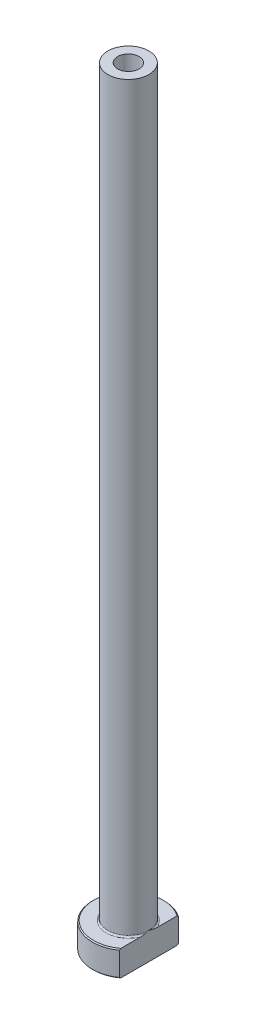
ISO-10303-21;
HEADER;
FILE_DESCRIPTION(('STEP AP214'),'2;1');
FILE_NAME('part.step','',(''),(''),'','','');
FILE_SCHEMA(('AUTOMOTIVE_DESIGN { 1 0 10303 214 1 1 1 1 }'));
ENDSEC;
DATA;
#1=APPLICATION_CONTEXT('core data for automotive mechanical design processes');
#2=APPLICATION_PROTOCOL_DEFINITION('international standard','automotive_design',2000,#1);
#3=PRODUCT_CONTEXT('',#1,'mechanical');
#4=PRODUCT('Part','Part','',(#3));
#5=PRODUCT_RELATED_PRODUCT_CATEGORY('part','',(#4));
#6=PRODUCT_DEFINITION_FORMATION('','',#4);
#7=PRODUCT_DEFINITION_CONTEXT('part definition',#1,'design');
#8=PRODUCT_DEFINITION('design','',#6,#7);
#9=PRODUCT_DEFINITION_SHAPE('','',#8);
#10=(LENGTH_UNIT() NAMED_UNIT(*) SI_UNIT(.MILLI.,.METRE.));
#11=(NAMED_UNIT(*) PLANE_ANGLE_UNIT() SI_UNIT($,.RADIAN.));
#12=(NAMED_UNIT(*) SI_UNIT($,.STERADIAN.) SOLID_ANGLE_UNIT());
#13=UNCERTAINTY_MEASURE_WITH_UNIT(LENGTH_MEASURE(1.E-05),#10,'distance_accuracy_value','');
#14=(GEOMETRIC_REPRESENTATION_CONTEXT(3) GLOBAL_UNCERTAINTY_ASSIGNED_CONTEXT((#13)) GLOBAL_UNIT_ASSIGNED_CONTEXT((#10,
#11,#12)) REPRESENTATION_CONTEXT('',''));
#15=CARTESIAN_POINT('',(0.,0.,0.));
#16=DIRECTION('',(0.,0.,1.));
#17=DIRECTION('',(1.,0.,0.));
#18=AXIS2_PLACEMENT_3D('',#15,#16,#17);
#19=CARTESIAN_POINT('',(0.,92.1876809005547,0.));
#20=DIRECTION('',(0.,1.,0.));
#21=DIRECTION('',(0.,0.,1.));
#22=AXIS2_PLACEMENT_3D('',#19,#20,#21);
#23=CYLINDRICAL_SURFACE('',#22,2.1);
#24=CARTESIAN_POINT('',(0.,150.,0.));
#25=DIRECTION('',(0.,1.,0.));
#26=DIRECTION('',(0.,0.,1.));
#27=AXIS2_PLACEMENT_3D('',#24,#25,#26);
#28=CIRCLE('',#27,2.1);
#29=CARTESIAN_POINT('',(0.,150.,2.1));
#30=VERTEX_POINT('',#29);
#31=EDGE_CURVE('E167',#30,#30,#28,.T.);
#32=ORIENTED_EDGE('',*,*,#31,.T.);
#33=EDGE_LOOP('',(#32));
#34=FACE_BOUND('',#33,.T.);
#35=CARTESIAN_POINT('',(0.,105.,0.));
#36=DIRECTION('',(0.,1.,0.));
#37=DIRECTION('',(0.,0.,1.));
#38=AXIS2_PLACEMENT_3D('',#35,#36,#37);
#39=CIRCLE('',#38,2.1);
#40=CARTESIAN_POINT('',(0.,105.,2.1));
#41=VERTEX_POINT('',#40);
#42=EDGE_CURVE('E170',#41,#41,#39,.T.);
#43=ORIENTED_EDGE('',*,*,#42,.F.);
#44=EDGE_LOOP('',(#43));
#45=FACE_BOUND('',#44,.T.);
#46=ADVANCED_FACE('F32',(#34,#45),#23,.F.);
#47=CARTESIAN_POINT('',(-2.1,150.,0.));
#48=DIRECTION('',(0.,1.,0.));
#49=DIRECTION('',(0.,0.,1.));
#50=AXIS2_PLACEMENT_3D('',#47,#48,#49);
#51=PLANE('',#50);
#52=CARTESIAN_POINT('',(0.,150.,0.));
#53=DIRECTION('',(0.,1.,0.));
#54=DIRECTION('',(0.,0.,1.));
#55=AXIS2_PLACEMENT_3D('',#52,#53,#54);
#56=CIRCLE('',#55,4.00000000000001);
#57=CARTESIAN_POINT('',(0.,150.,4.00000000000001));
#58=VERTEX_POINT('',#57);
#59=EDGE_CURVE('E174',#58,#58,#56,.T.);
#60=ORIENTED_EDGE('',*,*,#59,.T.);
#61=EDGE_LOOP('',(#60));
#62=FACE_BOUND('',#61,.T.);
#63=ORIENTED_EDGE('',*,*,#31,.F.);
#64=EDGE_LOOP('',(#63));
#65=FACE_BOUND('',#64,.T.);
#66=ADVANCED_FACE('F157',(#62,#65),#51,.T.);
#67=CARTESIAN_POINT('',(0.,92.1876809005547,0.));
#68=DIRECTION('',(0.,1.,0.));
#69=DIRECTION('',(0.,0.,1.));
#70=AXIS2_PLACEMENT_3D('',#67,#68,#69);
#71=CYLINDRICAL_SURFACE('',#70,4.);
#72=CARTESIAN_POINT('',(0.,5.3,0.));
#73=DIRECTION('',(0.,1.,0.));
#74=DIRECTION('',(0.,0.,1.));
#75=AXIS2_PLACEMENT_3D('',#72,#73,#74);
#76=CIRCLE('',#75,4.);
#77=CARTESIAN_POINT('',(4.,5.3,0.));
#78=VERTEX_POINT('',#77);
#79=EDGE_CURVE('E180',#78,#78,#76,.T.);
#80=ORIENTED_EDGE('',*,*,#79,.T.);
#81=EDGE_LOOP('',(#80));
#82=FACE_BOUND('',#81,.T.);
#83=ORIENTED_EDGE('',*,*,#59,.F.);
#84=EDGE_LOOP('',(#83));
#85=FACE_BOUND('',#84,.T.);
#86=ADVANCED_FACE('F162',(#82,#85),#71,.T.);
#87=CARTESIAN_POINT('',(-3.99999999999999,5.,0.));
#88=DIRECTION('',(0.,1.,0.));
#89=DIRECTION('',(0.,0.,1.));
#90=AXIS2_PLACEMENT_3D('',#87,#88,#89);
#91=PLANE('',#90);
#92=DIRECTION('',(0.,0.,1.));
#93=VECTOR('',#92,1.);
#94=CARTESIAN_POINT('',(4.,5.,0.));
#95=LINE('',#94,#93);
#96=CARTESIAN_POINT('',(4.,5.,-5.49909083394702));
#97=VERTEX_POINT('',#96);
#98=CARTESIAN_POINT('',(4.,5.,-1.57797338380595));
#99=VERTEX_POINT('',#98);
#100=EDGE_CURVE('E54',#97,#99,#95,.T.);
#101=ORIENTED_EDGE('',*,*,#100,.F.);
#102=CARTESIAN_POINT('',(0.,5.,0.));
#103=DIRECTION('',(0.,1.,0.));
#104=DIRECTION('',(0.,0.,1.));
#105=AXIS2_PLACEMENT_3D('',#102,#103,#104);
#106=CIRCLE('',#105,6.80000000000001);
#107=CARTESIAN_POINT('',(3.99999999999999,5.,5.49909083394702));
#108=VERTEX_POINT('',#107);
#109=EDGE_CURVE('E186',#97,#108,#106,.T.);
#110=ORIENTED_EDGE('',*,*,#109,.T.);
#111=CARTESIAN_POINT('',(4.,5.,1.57797338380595));
#112=VERTEX_POINT('',#111);
#113=EDGE_CURVE('E134',#112,#108,#95,.T.);
#114=ORIENTED_EDGE('',*,*,#113,.F.);
#115=CARTESIAN_POINT('',(0.,5.,0.));
#116=DIRECTION('',(0.,1.,0.));
#117=DIRECTION('',(0.,0.,1.));
#118=AXIS2_PLACEMENT_3D('',#115,#116,#117);
#119=CIRCLE('',#118,4.3);
#120=EDGE_CURVE('E183',#112,#99,#119,.F.);
#121=ORIENTED_EDGE('',*,*,#120,.T.);
#122=EDGE_LOOP('',(#101,#110,#114,#121));
#123=FACE_BOUND('',#122,.T.);
#124=ADVANCED_FACE('F197',(#123),#91,.T.);
#125=CARTESIAN_POINT('',(0.,92.1876809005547,0.));
#126=DIRECTION('',(0.,1.,0.));
#127=DIRECTION('',(0.,0.,1.));
#128=AXIS2_PLACEMENT_3D('',#125,#126,#127);
#129=CYLINDRICAL_SURFACE('',#128,6.99999999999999);
#130=DIRECTION('',(0.,-1.,0.));
#131=VECTOR('',#130,1.);
#132=CARTESIAN_POINT('',(3.99999999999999,150.,5.74456264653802));
#133=LINE('',#132,#131);
#134=CARTESIAN_POINT('',(3.99999999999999,4.8,5.74456264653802));
#135=VERTEX_POINT('',#134);
#136=CARTESIAN_POINT('',(3.99999999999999,0.200000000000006,5.74456264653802));
#137=VERTEX_POINT('',#136);
#138=EDGE_CURVE('E82',#135,#137,#133,.T.);
#139=ORIENTED_EDGE('',*,*,#138,.F.);
#140=CARTESIAN_POINT('',(0.,4.8,0.));
#141=DIRECTION('',(0.,1.,0.));
#142=DIRECTION('',(0.,0.,1.));
#143=AXIS2_PLACEMENT_3D('',#140,#141,#142);
#144=CIRCLE('',#143,6.99999999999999);
#145=CARTESIAN_POINT('',(4.,4.8,-5.74456264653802));
#146=VERTEX_POINT('',#145);
#147=EDGE_CURVE('E95',#135,#146,#144,.F.);
#148=ORIENTED_EDGE('',*,*,#147,.T.);
#149=DIRECTION('',(0.,-1.,0.));
#150=VECTOR('',#149,1.);
#151=CARTESIAN_POINT('',(4.,150.,-5.74456264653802));
#152=LINE('',#151,#150);
#153=CARTESIAN_POINT('',(4.,0.200000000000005,-5.74456264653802));
#154=VERTEX_POINT('',#153);
#155=EDGE_CURVE('E192',#146,#154,#152,.T.);
#156=ORIENTED_EDGE('',*,*,#155,.T.);
#157=CARTESIAN_POINT('',(0.,0.200000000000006,0.));
#158=DIRECTION('',(0.,-1.,0.));
#159=DIRECTION('',(0.,0.,-1.));
#160=AXIS2_PLACEMENT_3D('',#157,#158,#159);
#161=CIRCLE('',#160,6.99999999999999);
#162=EDGE_CURVE('E98',#154,#137,#161,.F.);
#163=ORIENTED_EDGE('',*,*,#162,.T.);
#164=EDGE_LOOP('',(#139,#148,#156,#163));
#165=FACE_BOUND('',#164,.T.);
#166=ADVANCED_FACE('F190',(#165),#129,.T.);
#167=CARTESIAN_POINT('',(-6.99999999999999,0.,0.));
#168=DIRECTION('',(0.,-1.,0.));
#169=DIRECTION('',(0.,0.,-1.));
#170=AXIS2_PLACEMENT_3D('',#167,#168,#169);
#171=PLANE('',#170);
#172=CARTESIAN_POINT('',(0.,0.,0.));
#173=DIRECTION('',(0.,-1.,0.));
#174=DIRECTION('',(0.,0.,-1.));
#175=AXIS2_PLACEMENT_3D('',#172,#173,#174);
#176=CIRCLE('',#175,2.84999999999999);
#177=CARTESIAN_POINT('',(0.,0.,-2.84999999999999));
#178=VERTEX_POINT('',#177);
#179=EDGE_CURVE('E40',#178,#178,#176,.F.);
#180=ORIENTED_EDGE('',*,*,#179,.T.);
#181=EDGE_LOOP('',(#180));
#182=FACE_BOUND('',#181,.T.);
#183=DIRECTION('',(0.,0.,-1.));
#184=VECTOR('',#183,1.);
#185=CARTESIAN_POINT('',(3.99999999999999,0.,5.74456264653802));
#186=LINE('',#185,#184);
#187=CARTESIAN_POINT('',(3.99999999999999,0.,5.49909083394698));
#188=VERTEX_POINT('',#187);
#189=CARTESIAN_POINT('',(4.,0.,-5.49909083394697));
#190=VERTEX_POINT('',#189);
#191=EDGE_CURVE('E47',#188,#190,#186,.T.);
#192=ORIENTED_EDGE('',*,*,#191,.F.);
#193=CARTESIAN_POINT('',(0.,0.,0.));
#194=DIRECTION('',(0.,-1.,0.));
#195=DIRECTION('',(0.,0.,-1.));
#196=AXIS2_PLACEMENT_3D('',#193,#194,#195);
#197=CIRCLE('',#196,6.79999999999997);
#198=EDGE_CURVE('E92',#188,#190,#197,.T.);
#199=ORIENTED_EDGE('',*,*,#198,.T.);
#200=EDGE_LOOP('',(#192,#199));
#201=FACE_BOUND('',#200,.T.);
#202=ADVANCED_FACE('F91',(#182,#201),#171,.T.);
#203=CARTESIAN_POINT('',(0.,92.1876809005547,0.));
#204=DIRECTION('',(0.,1.,0.));
#205=DIRECTION('',(0.,0.,1.));
#206=AXIS2_PLACEMENT_3D('',#203,#204,#205);
#207=CYLINDRICAL_SURFACE('',#206,2.35);
#208=CARTESIAN_POINT('',(0.,0.499999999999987,0.));
#209=DIRECTION('',(0.,-1.,0.));
#210=DIRECTION('',(0.,0.,-1.));
#211=AXIS2_PLACEMENT_3D('',#208,#209,#210);
#212=CIRCLE('',#211,2.35);
#213=CARTESIAN_POINT('',(0.,0.499999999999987,-2.35));
#214=VERTEX_POINT('',#213);
#215=EDGE_CURVE('E11',#214,#214,#212,.T.);
#216=ORIENTED_EDGE('',*,*,#215,.T.);
#217=EDGE_LOOP('',(#216));
#218=FACE_BOUND('',#217,.T.);
#219=CARTESIAN_POINT('',(0.,93.,0.));
#220=DIRECTION('',(0.,1.,0.));
#221=DIRECTION('',(0.,0.,1.));
#222=AXIS2_PLACEMENT_3D('',#219,#220,#221);
#223=CIRCLE('',#222,2.35);
#224=CARTESIAN_POINT('',(0.,93.,2.35));
#225=VERTEX_POINT('',#224);
#226=EDGE_CURVE('E172',#225,#225,#223,.T.);
#227=ORIENTED_EDGE('',*,*,#226,.T.);
#228=EDGE_LOOP('',(#227));
#229=FACE_BOUND('',#228,.T.);
#230=ADVANCED_FACE('F215',(#218,#229),#207,.F.);
#231=CARTESIAN_POINT('',(0.,93.,0.));
#232=DIRECTION('',(0.,-1.,0.));
#233=DIRECTION('',(0.,0.,-1.));
#234=AXIS2_PLACEMENT_3D('',#231,#232,#233);
#235=CONICAL_SURFACE('',#234,2.35,0.0208303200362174);
#236=ORIENTED_EDGE('',*,*,#42,.T.);
#237=EDGE_LOOP('',(#236));
#238=FACE_BOUND('',#237,.T.);
#239=ORIENTED_EDGE('',*,*,#226,.F.);
#240=EDGE_LOOP('',(#239));
#241=FACE_BOUND('',#240,.T.);
#242=ADVANCED_FACE('F111',(#238,#241),#235,.F.);
#243=CARTESIAN_POINT('',(0.,5.3,0.));
#244=DIRECTION('',(0.,1.,0.));
#245=DIRECTION('',(0.,0.,1.));
#246=AXIS2_PLACEMENT_3D('',#243,#244,#245);
#247=TOROIDAL_SURFACE('',#246,4.3,0.3);
#248=ORIENTED_EDGE('',*,*,#120,.F.);
#249=CARTESIAN_POINT('',(4.,5.3,0.));
#250=CARTESIAN_POINT('',(4.,5.3000006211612,-1.06261408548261E-10));
#251=CARTESIAN_POINT('',(4.,5.30000124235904,2.17726046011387E-07));
#252=CARTESIAN_POINT('',(4.,5.30000240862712,8.3614095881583E-07));
#253=CARTESIAN_POINT('',(4.,5.30000294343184,1.25011675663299E-06));
#254=CARTESIAN_POINT('',(4.,5.30000404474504,2.23959330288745E-06));
#255=CARTESIAN_POINT('',(4.,5.30000459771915,2.83084453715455E-06));
#256=CARTESIAN_POINT('',(4.,5.30000559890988,4.06516593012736E-06));
#257=CARTESIAN_POINT('',(4.,5.30000604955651,4.70640072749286E-06));
#258=CARTESIAN_POINT('',(4.,5.30000769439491,7.15677192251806E-06));
#259=CARTESIAN_POINT('',(4.,5.30000879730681,9.02995955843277E-06));
#260=CARTESIAN_POINT('',(4.,5.3000106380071,1.27664884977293E-05));
#261=CARTESIAN_POINT('',(4.,5.30001139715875,1.46197804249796E-05));
#262=CARTESIAN_POINT('',(4.,5.30001453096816,2.23679219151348E-05));
#263=CARTESIAN_POINT('',(4.,5.30001683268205,2.82968746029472E-05));
#264=CARTESIAN_POINT('',(4.,5.30002027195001,3.95668726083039E-05));
#265=CARTESIAN_POINT('',(4.,5.30002152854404,4.48715457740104E-05));
#266=CARTESIAN_POINT('',(4.,5.30003060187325,8.40118194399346E-05));
#267=CARTESIAN_POINT('',(4.,5.30003739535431,0.00011802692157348));
#268=CARTESIAN_POINT('',(3.99999999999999,5.30006713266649,0.000252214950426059));
#269=CARTESIAN_POINT('',(4.,5.30009559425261,0.000351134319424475));
#270=CARTESIAN_POINT('',(4.,5.30020622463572,0.000742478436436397));
#271=CARTESIAN_POINT('',(4.,5.30028475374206,0.00103561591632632));
#272=CARTESIAN_POINT('',(3.99999999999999,5.30059889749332,0.0021992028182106));
#273=CARTESIAN_POINT('',(3.99999999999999,5.30083905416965,0.00306873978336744));
#274=CARTESIAN_POINT('',(4.,5.30183682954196,0.0066914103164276));
#275=CARTESIAN_POINT('',(4.,5.30258877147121,0.00944568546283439));
#276=CARTESIAN_POINT('',(3.99999999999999,5.31066890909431,0.039029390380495));
#277=CARTESIAN_POINT('',(3.99999999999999,5.31802631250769,0.0658531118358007));
#278=CARTESIAN_POINT('',(4.,5.33239676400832,0.118441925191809));
#279=CARTESIAN_POINT('',(4.,5.3394118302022,0.144206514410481));
#280=CARTESIAN_POINT('',(3.99999999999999,5.35427366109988,0.199017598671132));
#281=CARTESIAN_POINT('',(4.,5.36211313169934,0.228066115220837));
#282=CARTESIAN_POINT('',(4.,5.37776349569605,0.286511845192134));
#283=CARTESIAN_POINT('',(4.,5.38557313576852,0.315909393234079));
#284=CARTESIAN_POINT('',(4.,5.40425662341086,0.386994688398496));
#285=CARTESIAN_POINT('',(4.,5.41505237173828,0.428703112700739));
#286=CARTESIAN_POINT('',(4.,5.43592310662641,0.511098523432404));
#287=CARTESIAN_POINT('',(4.,5.44600969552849,0.551782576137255));
#288=CARTESIAN_POINT('',(4.,5.47850986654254,0.686599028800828));
#289=CARTESIAN_POINT('',(4.,5.49978370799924,0.78101186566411));
#290=CARTESIAN_POINT('',(4.,5.53807543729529,0.971847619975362));
#291=CARTESIAN_POINT('',(4.,5.55504273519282,1.06828120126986));
#292=CARTESIAN_POINT('',(4.,5.57582405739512,1.21752725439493));
#293=CARTESIAN_POINT('',(4.,5.58209796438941,1.26999379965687));
#294=CARTESIAN_POINT('',(4.,5.59210686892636,1.37516324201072));
#295=CARTESIAN_POINT('',(4.,5.59584265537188,1.42786606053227));
#296=CARTESIAN_POINT('',(4.,5.60010438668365,1.5331067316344));
#297=CARTESIAN_POINT('',(4.,5.6006487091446,1.58564378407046));
#298=CARTESIAN_POINT('',(4.,5.59767158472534,1.69058605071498));
#299=CARTESIAN_POINT('',(4.,5.59415502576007,1.74299134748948));
#300=CARTESIAN_POINT('',(4.,5.5850306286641,1.81903290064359));
#301=CARTESIAN_POINT('',(4.,5.58157617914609,1.84292934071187));
#302=CARTESIAN_POINT('',(4.,5.57329952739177,1.89051061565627));
#303=CARTESIAN_POINT('',(4.,5.5684761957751,1.91419525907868));
#304=CARTESIAN_POINT('',(4.,5.55726644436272,1.96092888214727));
#305=CARTESIAN_POINT('',(4.,5.55089740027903,1.98398195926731));
#306=CARTESIAN_POINT('',(4.,5.53623434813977,2.02945550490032));
#307=CARTESIAN_POINT('',(4.,5.52794253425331,2.05187666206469));
#308=CARTESIAN_POINT('',(4.,5.5088709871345,2.09590631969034));
#309=CARTESIAN_POINT('',(4.,5.49806837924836,2.11750508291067));
#310=CARTESIAN_POINT('',(4.,5.47333401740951,2.15885583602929));
#311=CARTESIAN_POINT('',(4.,5.45941272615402,2.17861369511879));
#312=CARTESIAN_POINT('',(4.,5.43588221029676,2.20522942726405));
#313=CARTESIAN_POINT('',(4.,5.42781139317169,2.21344043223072));
#314=CARTESIAN_POINT('',(4.,5.41065114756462,2.22875149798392));
#315=CARTESIAN_POINT('',(4.,5.40156129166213,2.23585108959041));
#316=CARTESIAN_POINT('',(4.,5.38220524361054,2.24859694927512));
#317=CARTESIAN_POINT('',(4.,5.37192420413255,2.25422119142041));
#318=CARTESIAN_POINT('',(4.,5.35045072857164,2.26331064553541));
#319=CARTESIAN_POINT('',(4.,5.33926122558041,2.26678251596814));
#320=CARTESIAN_POINT('',(4.,5.31952044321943,2.27051268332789));
#321=CARTESIAN_POINT('',(4.,5.31108453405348,2.27139016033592));
#322=CARTESIAN_POINT('',(4.,5.29418624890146,2.27168963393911));
#323=CARTESIAN_POINT('',(4.,5.28572387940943,2.27111196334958));
#324=CARTESIAN_POINT('',(4.,5.26904138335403,2.26855580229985));
#325=CARTESIAN_POINT('',(4.,5.26082066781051,2.26658107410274));
#326=CARTESIAN_POINT('',(4.,5.24478214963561,2.26139496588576));
#327=CARTESIAN_POINT('',(4.,5.23696461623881,2.25818277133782));
#328=CARTESIAN_POINT('',(4.,5.21851235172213,2.24908332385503));
#329=CARTESIAN_POINT('',(4.,5.20815219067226,2.24264095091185));
#330=CARTESIAN_POINT('',(4.,5.18857975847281,2.22819957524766));
#331=CARTESIAN_POINT('',(4.,5.17937061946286,2.22019647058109));
#332=CARTESIAN_POINT('',(4.,5.15665383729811,2.19777756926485));
#333=CARTESIAN_POINT('',(4.,5.1440348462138,2.18246908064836));
#334=CARTESIAN_POINT('',(4.,5.1211836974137,2.15020843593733));
#335=CARTESIAN_POINT('',(4.,5.11095480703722,2.13325407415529));
#336=CARTESIAN_POINT('',(4.,5.09273574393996,2.0989232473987));
#337=CARTESIAN_POINT('',(4.,5.0846821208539,2.08157988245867));
#338=CARTESIAN_POINT('',(4.,5.0700590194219,2.0462707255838));
#339=CARTESIAN_POINT('',(4.,5.06349101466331,2.02830433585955));
#340=CARTESIAN_POINT('',(4.,5.04555485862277,1.97350761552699));
#341=CARTESIAN_POINT('',(4.,5.03608974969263,1.93605770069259));
#342=CARTESIAN_POINT('',(4.,5.01780569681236,1.84529235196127));
#343=CARTESIAN_POINT('',(4.,5.01077018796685,1.79164082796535));
#344=CARTESIAN_POINT('',(4.,5.00182846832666,1.68379947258));
#345=CARTESIAN_POINT('',(4.,4.9999388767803,1.62960846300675));
#346=CARTESIAN_POINT('',(4.,5.00006129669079,1.52361204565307));
#347=CARTESIAN_POINT('',(4.,5.00190698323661,1.47180551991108));
#348=CARTESIAN_POINT('',(4.,5.00841243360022,1.36835357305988));
#349=CARTESIAN_POINT('',(4.,5.01307376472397,1.31670825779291));
#350=CARTESIAN_POINT('',(4.,5.02905484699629,1.17431887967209));
#351=CARTESIAN_POINT('',(4.,5.04274090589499,1.08384207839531));
#352=CARTESIAN_POINT('',(4.,5.06701714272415,0.94775795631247));
#353=CARTESIAN_POINT('',(4.,5.0758557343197,0.901814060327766));
#354=CARTESIAN_POINT('',(4.,5.09458665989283,0.810008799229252));
#355=CARTESIAN_POINT('',(4.,5.10448180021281,0.764148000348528));
#356=CARTESIAN_POINT('',(4.,5.12892434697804,0.655631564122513));
#357=CARTESIAN_POINT('',(4.,5.14383556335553,0.593058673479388));
#358=CARTESIAN_POINT('',(4.,5.17458762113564,0.468885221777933));
#359=CARTESIAN_POINT('',(3.99999999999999,5.19041623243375,0.407281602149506));
#360=CARTESIAN_POINT('',(4.,5.22090834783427,0.291232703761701));
#361=CARTESIAN_POINT('',(4.,5.23550024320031,0.236768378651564));
#362=CARTESIAN_POINT('',(3.99999999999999,5.26562550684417,0.125604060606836));
#363=CARTESIAN_POINT('',(3.99999999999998,5.28117250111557,0.0689076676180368));
#364=CARTESIAN_POINT('',(4.,5.29741226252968,0.00944154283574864));
#365=CARTESIAN_POINT('',(4.,5.29816540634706,0.00668315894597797));
#366=CARTESIAN_POINT('',(3.99999999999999,5.29916346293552,0.00305954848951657));
#367=CARTESIAN_POINT('',(3.99999999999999,5.29940273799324,0.00219318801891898));
#368=CARTESIAN_POINT('',(4.,5.29971580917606,0.00103357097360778));
#369=CARTESIAN_POINT('',(4.,5.29979412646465,0.000741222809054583));
#370=CARTESIAN_POINT('',(4.,5.29990450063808,0.000350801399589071));
#371=CARTESIAN_POINT('',(3.99999999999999,5.29993292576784,0.000252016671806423));
#372=CARTESIAN_POINT('',(4.,5.29996263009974,0.000117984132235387));
#373=CARTESIAN_POINT('',(4.,5.29996941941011,8.39881887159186E-05));
#374=CARTESIAN_POINT('',(4.,5.29997848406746,4.4867400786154E-05));
#375=CARTESIAN_POINT('',(4.,5.2999797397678,3.95638181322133E-05));
#376=CARTESIAN_POINT('',(4.,5.29998317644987,2.82960330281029E-05));
#377=CARTESIAN_POINT('',(4.,5.29998547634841,2.23681449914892E-05));
#378=CARTESIAN_POINT('',(4.,5.29998860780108,1.46210997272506E-05));
#379=CARTESIAN_POINT('',(4.,5.29998936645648,1.27678895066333E-05));
#380=CARTESIAN_POINT('',(4.,5.29999120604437,9.03144008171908E-06));
#381=CARTESIAN_POINT('',(4.,5.29999230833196,7.15824051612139E-06));
#382=CARTESIAN_POINT('',(4.,5.29999395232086,4.70775500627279E-06));
#383=CARTESIAN_POINT('',(4.,5.29999440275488,4.06646363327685E-06));
#384=CARTESIAN_POINT('',(4.,5.29999540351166,2.83199071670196E-06));
#385=CARTESIAN_POINT('',(4.,5.29999595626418,2.24064331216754E-06));
#386=CARTESIAN_POINT('',(4.,5.29999705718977,1.25093964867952E-06));
#387=CARTESIAN_POINT('',(4.,5.29999759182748,8.36841013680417E-07));
#388=CARTESIAN_POINT('',(4.,5.29999875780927,2.1811772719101E-07));
#389=CARTESIAN_POINT('',(4.,5.29999937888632,1.06254485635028E-10));
#390=CARTESIAN_POINT('',(4.,5.3,0.));
#391=B_SPLINE_CURVE_WITH_KNOTS('',3,(#249,#250,#251,#252,#253,#254,#255,#256,#257,#258,#259,
#260,#261,#262,#263,#264,#265,#266,#267,#268,#269,#270,#271,#272,#273,#274,#275,#276,#277,#278,
#279,#280,#281,#282,#283,#284,#285,#286,#287,#288,#289,#290,#291,#292,#293,#294,#295,#296,#297,
#298,#299,#300,#301,#302,#303,#304,#305,#306,#307,#308,#309,#310,#311,#312,#313,#314,#315,#316,
#317,#318,#319,#320,#321,#322,#323,#324,#325,#326,#327,#328,#329,#330,#331,#332,#333,#334,#335,
#336,#337,#338,#339,#340,#341,#342,#343,#344,#345,#346,#347,#348,#349,#350,#351,#352,#353,#354,
#355,#356,#357,#358,#359,#360,#361,#362,#363,#364,#365,#366,#367,#368,#369,#370,#371,#372,#373,
#374,#375,#376,#377,#378,#379,#380,#381,#382,#383,#384,#385,#386,#387,#388,#389,#390),
.UNSPECIFIED.,.T.,.F.,(4,2,2,2,2,2,2,2,2,2,2,2,2,2,2,2,2,2,2,2,2,2,2,2,2,2,2,2,2,2,2,2,2,2,2,2,
2,2,2,2,2,2,2,2,2,2,2,2,2,2,2,2,2,2,2,2,2,2,2,2,2,2,2,2,2,2,2,2,2,2,4),(0.,1.87484466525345E-06,
3.90180119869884E-06,6.31683969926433E-06,8.66652145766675E-06,1.51627575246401E-05,
2.11657959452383E-05,4.0209080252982E-05,5.654295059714E-05,0.000160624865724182,
0.000469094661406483,0.00137985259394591,0.00408571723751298,0.0126514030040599,
0.0960918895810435,0.17620014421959,0.26646304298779,0.357714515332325,0.486961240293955,
0.612707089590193,0.90298810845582,1.1965358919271,1.35501075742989,1.51343634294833,
1.67094875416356,1.82827177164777,1.90067591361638,1.97313996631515,2.04482437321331,
2.11642737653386,2.1887102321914,2.26075412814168,2.29521947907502,2.32969934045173,
2.36466792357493,2.39952778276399,2.42485422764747,2.45017488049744,2.47542760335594,
2.50069697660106,2.53708899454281,2.57357798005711,2.63276032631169,2.69202310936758,
2.7493031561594,2.80663977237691,2.92223125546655,3.08420752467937,3.24670629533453,
3.40212850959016,3.55763731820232,3.83192962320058,3.97228382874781,4.11302057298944,
4.3059813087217,4.49678885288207,4.66594443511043,4.84230602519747,4.85088453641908,
4.85358051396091,4.85448881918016,4.85479687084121,4.85490089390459,4.85491722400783,
4.85493626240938,4.85494226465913,4.85494875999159,4.85495110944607,4.85495352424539,
4.85495555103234,4.85495742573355),.UNSPECIFIED.);
#392=EDGE_CURVE('E126',#112,#78,#391,.T.);
#393=ORIENTED_EDGE('',*,*,#392,.T.);
#394=ORIENTED_EDGE('',*,*,#79,.F.);
#395=CARTESIAN_POINT('',(4.,5.3,0.));
#396=CARTESIAN_POINT('',(4.,5.29999937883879,1.06262613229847E-10));
#397=CARTESIAN_POINT('',(4.,5.29999875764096,-2.17726044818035E-07));
#398=CARTESIAN_POINT('',(4.,5.29999759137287,-8.36140957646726E-07));
#399=CARTESIAN_POINT('',(4.,5.29999705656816,-1.25011675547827E-06));
#400=CARTESIAN_POINT('',(4.,5.29999595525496,-2.23959330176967E-06));
#401=CARTESIAN_POINT('',(4.,5.29999540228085,-2.83084453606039E-06));
#402=CARTESIAN_POINT('',(4.,5.29999440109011,-4.06516592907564E-06));
#403=CARTESIAN_POINT('',(4.,5.29999395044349,-4.70640072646E-06));
#404=CARTESIAN_POINT('',(4.,5.29999230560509,-7.15677192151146E-06));
#405=CARTESIAN_POINT('',(4.,5.29999120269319,-9.02995955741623E-06));
#406=CARTESIAN_POINT('',(4.,5.2999893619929,-1.27664884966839E-05));
#407=CARTESIAN_POINT('',(4.,5.29998860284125,-1.46197804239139E-05));
#408=CARTESIAN_POINT('',(4.,5.29998546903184,-2.23679219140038E-05));
#409=CARTESIAN_POINT('',(4.,5.29998316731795,-2.82968746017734E-05));
#410=CARTESIAN_POINT('',(4.,5.29997972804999,-3.95668726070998E-05));
#411=CARTESIAN_POINT('',(4.,5.29997847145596,-4.48715457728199E-05));
#412=CARTESIAN_POINT('',(4.,5.29996939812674,-8.40118194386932E-05));
#413=CARTESIAN_POINT('',(4.,5.29996260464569,-0.000118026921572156));
#414=CARTESIAN_POINT('',(3.99999999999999,5.29993286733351,-0.000252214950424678));
#415=CARTESIAN_POINT('',(4.,5.29990440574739,-0.000351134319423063));
#416=CARTESIAN_POINT('',(4.,5.29979377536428,-0.000742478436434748));
#417=CARTESIAN_POINT('',(4.,5.29971524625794,-0.00103561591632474));
#418=CARTESIAN_POINT('',(3.99999999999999,5.29940110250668,-0.00219920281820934));
#419=CARTESIAN_POINT('',(3.99999999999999,5.29916094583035,-0.0030687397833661));
#420=CARTESIAN_POINT('',(4.,5.29816317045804,-0.00669141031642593));
#421=CARTESIAN_POINT('',(4.,5.29741122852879,-0.00944568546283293));
#422=CARTESIAN_POINT('',(3.99999999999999,5.28933109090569,-0.0390293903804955));
#423=CARTESIAN_POINT('',(3.99999999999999,5.28197368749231,-0.0658531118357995));
#424=CARTESIAN_POINT('',(4.,5.26760323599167,-0.118441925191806));
#425=CARTESIAN_POINT('',(4.,5.26058816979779,-0.144206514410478));
#426=CARTESIAN_POINT('',(3.99999999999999,5.24572633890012,-0.199017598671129));
#427=CARTESIAN_POINT('',(4.,5.23788686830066,-0.228066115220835));
#428=CARTESIAN_POINT('',(4.,5.22223650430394,-0.286511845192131));
#429=CARTESIAN_POINT('',(4.,5.21442686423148,-0.315909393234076));
#430=CARTESIAN_POINT('',(4.,5.19574337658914,-0.386994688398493));
#431=CARTESIAN_POINT('',(4.,5.18494762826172,-0.428703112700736));
#432=CARTESIAN_POINT('',(4.,5.16407689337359,-0.511098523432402));
#433=CARTESIAN_POINT('',(4.,5.15399030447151,-0.551782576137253));
#434=CARTESIAN_POINT('',(4.,5.12149013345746,-0.686599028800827));
#435=CARTESIAN_POINT('',(4.,5.10021629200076,-0.781011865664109));
#436=CARTESIAN_POINT('',(4.,5.06192456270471,-0.971847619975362));
#437=CARTESIAN_POINT('',(4.,5.04495726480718,-1.06828120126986));
#438=CARTESIAN_POINT('',(4.,5.02417594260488,-1.21752725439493));
#439=CARTESIAN_POINT('',(4.,5.01790203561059,-1.26999379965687));
#440=CARTESIAN_POINT('',(4.,5.00789313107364,-1.37516324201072));
#441=CARTESIAN_POINT('',(4.,5.00415734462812,-1.42786606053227));
#442=CARTESIAN_POINT('',(4.,4.99989561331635,-1.5331067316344));
#443=CARTESIAN_POINT('',(4.,4.9993512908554,-1.58564378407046));
#444=CARTESIAN_POINT('',(4.,5.00232841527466,-1.69058605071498));
#445=CARTESIAN_POINT('',(4.,5.00584497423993,-1.74299134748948));
#446=CARTESIAN_POINT('',(4.,5.01496937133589,-1.81903290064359));
#447=CARTESIAN_POINT('',(4.,5.01842382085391,-1.84292934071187));
#448=CARTESIAN_POINT('',(4.,5.02670047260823,-1.89051061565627));
#449=CARTESIAN_POINT('',(4.,5.0315238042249,-1.91419525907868));
#450=CARTESIAN_POINT('',(4.,5.04273355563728,-1.96092888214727));
#451=CARTESIAN_POINT('',(4.,5.04910259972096,-1.98398195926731));
#452=CARTESIAN_POINT('',(4.,5.06376565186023,-2.02945550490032));
#453=CARTESIAN_POINT('',(4.,5.07205746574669,-2.05187666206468));
#454=CARTESIAN_POINT('',(4.,5.09112901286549,-2.09590631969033));
#455=CARTESIAN_POINT('',(4.,5.10193162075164,-2.11750508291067));
#456=CARTESIAN_POINT('',(4.,5.12666598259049,-2.15885583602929));
#457=CARTESIAN_POINT('',(4.,5.14058727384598,-2.17861369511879));
#458=CARTESIAN_POINT('',(4.,5.16411778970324,-2.20522942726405));
#459=CARTESIAN_POINT('',(4.,5.17218860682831,-2.21344043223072));
#460=CARTESIAN_POINT('',(4.,5.18934885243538,-2.22875149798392));
#461=CARTESIAN_POINT('',(4.,5.19843870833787,-2.23585108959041));
#462=CARTESIAN_POINT('',(4.,5.21779475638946,-2.24859694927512));
#463=CARTESIAN_POINT('',(4.,5.22807579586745,-2.25422119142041));
#464=CARTESIAN_POINT('',(4.,5.24954927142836,-2.26331064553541));
#465=CARTESIAN_POINT('',(4.,5.26073877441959,-2.26678251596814));
#466=CARTESIAN_POINT('',(4.,5.28047955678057,-2.27051268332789));
#467=CARTESIAN_POINT('',(4.,5.28891546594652,-2.27139016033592));
#468=CARTESIAN_POINT('',(4.,5.30581375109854,-2.2716896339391));
#469=CARTESIAN_POINT('',(4.,5.31427612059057,-2.27111196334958));
#470=CARTESIAN_POINT('',(4.,5.33095861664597,-2.26855580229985));
#471=CARTESIAN_POINT('',(4.,5.33917933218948,-2.26658107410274));
#472=CARTESIAN_POINT('',(4.,5.35521785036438,-2.26139496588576));
#473=CARTESIAN_POINT('',(4.,5.36303538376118,-2.25818277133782));
#474=CARTESIAN_POINT('',(4.,5.38148764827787,-2.24908332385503));
#475=CARTESIAN_POINT('',(4.,5.39184780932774,-2.24264095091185));
#476=CARTESIAN_POINT('',(4.,5.41142024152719,-2.22819957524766));
#477=CARTESIAN_POINT('',(4.,5.42062938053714,-2.22019647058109));
#478=CARTESIAN_POINT('',(4.,5.44334616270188,-2.19777756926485));
#479=CARTESIAN_POINT('',(4.,5.4559651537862,-2.18246908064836));
#480=CARTESIAN_POINT('',(4.,5.4788163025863,-2.15020843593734));
#481=CARTESIAN_POINT('',(4.,5.48904519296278,-2.13325407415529));
#482=CARTESIAN_POINT('',(4.,5.50726425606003,-2.0989232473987));
#483=CARTESIAN_POINT('',(4.,5.5153178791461,-2.08157988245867));
#484=CARTESIAN_POINT('',(4.,5.5299409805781,-2.0462707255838));
#485=CARTESIAN_POINT('',(4.,5.53650898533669,-2.02830433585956));
#486=CARTESIAN_POINT('',(4.,5.55444514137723,-1.973507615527));
#487=CARTESIAN_POINT('',(4.,5.56391025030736,-1.9360577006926));
#488=CARTESIAN_POINT('',(4.,5.58219430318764,-1.84529235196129));
#489=CARTESIAN_POINT('',(4.,5.58922981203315,-1.79164082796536));
#490=CARTESIAN_POINT('',(4.,5.59817153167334,-1.68379947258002));
#491=CARTESIAN_POINT('',(4.,5.6000611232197,-1.62960846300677));
#492=CARTESIAN_POINT('',(4.,5.59993870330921,-1.52361204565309));
#493=CARTESIAN_POINT('',(4.,5.59809301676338,-1.47180551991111));
#494=CARTESIAN_POINT('',(4.,5.59158756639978,-1.3683535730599));
#495=CARTESIAN_POINT('',(4.,5.58692623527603,-1.31670825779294));
#496=CARTESIAN_POINT('',(4.,5.57094515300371,-1.17431887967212));
#497=CARTESIAN_POINT('',(4.,5.55725909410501,-1.08384207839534));
#498=CARTESIAN_POINT('',(4.,5.53298285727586,-0.947757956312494));
#499=CARTESIAN_POINT('',(4.,5.5241442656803,-0.901814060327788));
#500=CARTESIAN_POINT('',(4.,5.50541334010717,-0.810008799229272));
#501=CARTESIAN_POINT('',(4.,5.49551819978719,-0.764148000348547));
#502=CARTESIAN_POINT('',(4.,5.47107565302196,-0.65563156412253));
#503=CARTESIAN_POINT('',(4.,5.45616443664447,-0.593058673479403));
#504=CARTESIAN_POINT('',(4.,5.42541237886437,-0.468885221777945));
#505=CARTESIAN_POINT('',(3.99999999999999,5.40958376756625,-0.407281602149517));
#506=CARTESIAN_POINT('',(4.,5.37909165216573,-0.291232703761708));
#507=CARTESIAN_POINT('',(4.,5.36449975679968,-0.23676837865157));
#508=CARTESIAN_POINT('',(3.99999999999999,5.33437449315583,-0.125604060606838));
#509=CARTESIAN_POINT('',(3.99999999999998,5.31882749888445,-0.0689076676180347));
#510=CARTESIAN_POINT('',(4.,5.30258773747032,-0.00944154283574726));
#511=CARTESIAN_POINT('',(4.,5.30183459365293,-0.00668315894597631));
#512=CARTESIAN_POINT('',(3.99999999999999,5.30083653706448,-0.00305954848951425));
#513=CARTESIAN_POINT('',(3.99999999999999,5.30059726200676,-0.0021931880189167));
#514=CARTESIAN_POINT('',(4.,5.30028419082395,-0.00103357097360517));
#515=CARTESIAN_POINT('',(4.,5.30020587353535,-0.000741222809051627));
#516=CARTESIAN_POINT('',(4.,5.30009549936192,-0.000350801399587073));
#517=CARTESIAN_POINT('',(3.99999999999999,5.30006707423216,-0.000252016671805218));
#518=CARTESIAN_POINT('',(4.,5.30003736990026,-0.000117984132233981));
#519=CARTESIAN_POINT('',(4.,5.30003058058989,-8.39881887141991E-05));
#520=CARTESIAN_POINT('',(4.,5.30002151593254,-4.48674007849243E-05));
#521=CARTESIAN_POINT('',(4.,5.3000202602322,-3.95638181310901E-05));
#522=CARTESIAN_POINT('',(4.,5.30001682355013,-2.82960330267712E-05));
#523=CARTESIAN_POINT('',(4.,5.30001452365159,-2.23681449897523E-05));
#524=CARTESIAN_POINT('',(4.,5.30001139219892,-1.46210997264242E-05));
#525=CARTESIAN_POINT('',(4.,5.30001063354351,-1.27678895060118E-05));
#526=CARTESIAN_POINT('',(4.,5.30000879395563,-9.03144008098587E-06));
#527=CARTESIAN_POINT('',(4.,5.30000769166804,-7.15824051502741E-06));
#528=CARTESIAN_POINT('',(4.,5.30000604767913,-4.70775500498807E-06));
#529=CARTESIAN_POINT('',(4.,5.30000559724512,-4.06646363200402E-06));
#530=CARTESIAN_POINT('',(4.,5.30000459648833,-2.83199071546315E-06));
#531=CARTESIAN_POINT('',(4.,5.30000404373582,-2.24064331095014E-06));
#532=CARTESIAN_POINT('',(4.,5.30000294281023,-1.25093964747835E-06));
#533=CARTESIAN_POINT('',(4.,5.30000240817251,-8.36841012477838E-07));
#534=CARTESIAN_POINT('',(4.,5.30000124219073,-2.18117725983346E-07));
#535=CARTESIAN_POINT('',(4.,5.30000062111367,-1.06253274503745E-10));
#536=CARTESIAN_POINT('',(4.,5.3,0.));
#537=B_SPLINE_CURVE_WITH_KNOTS('',3,(#395,#396,#397,#398,#399,#400,#401,#402,#403,#404,#405,
#406,#407,#408,#409,#410,#411,#412,#413,#414,#415,#416,#417,#418,#419,#420,#421,#422,#423,#424,
#425,#426,#427,#428,#429,#430,#431,#432,#433,#434,#435,#436,#437,#438,#439,#440,#441,#442,#443,
#444,#445,#446,#447,#448,#449,#450,#451,#452,#453,#454,#455,#456,#457,#458,#459,#460,#461,#462,
#463,#464,#465,#466,#467,#468,#469,#470,#471,#472,#473,#474,#475,#476,#477,#478,#479,#480,#481,
#482,#483,#484,#485,#486,#487,#488,#489,#490,#491,#492,#493,#494,#495,#496,#497,#498,#499,#500,
#501,#502,#503,#504,#505,#506,#507,#508,#509,#510,#511,#512,#513,#514,#515,#516,#517,#518,#519,
#520,#521,#522,#523,#524,#525,#526,#527,#528,#529,#530,#531,#532,#533,#534,#535,#536),
.UNSPECIFIED.,.T.,.F.,(4,2,2,2,2,2,2,2,2,2,2,2,2,2,2,2,2,2,2,2,2,2,2,2,2,2,2,2,2,2,2,2,2,2,2,2,
2,2,2,2,2,2,2,2,2,2,2,2,2,2,2,2,2,2,2,2,2,2,2,2,2,2,2,2,2,2,2,2,2,2,4),(0.,1.87484466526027E-06,
3.90180119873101E-06,6.31683969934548E-06,8.66652145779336E-06,1.51627575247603E-05,
2.11657959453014E-05,4.0209080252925E-05,5.65429505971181E-05,0.00016062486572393,
0.000469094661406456,0.00137985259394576,0.00408571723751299,0.0126514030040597,
0.0960918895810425,0.176200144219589,0.266463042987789,0.357714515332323,0.486961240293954,
0.612707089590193,0.90298810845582,1.19653589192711,1.35501075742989,1.51343634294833,
1.67094875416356,1.82827177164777,1.90067591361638,1.97313996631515,2.04482437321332,
2.11642737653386,2.1887102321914,2.26075412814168,2.29521947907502,2.32969934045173,
2.36466792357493,2.39952778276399,2.42485422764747,2.45017488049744,2.47542760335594,
2.50069697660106,2.5370889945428,2.57357798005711,2.63276032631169,2.69202310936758,
2.74930315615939,2.80663977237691,2.92223125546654,3.08420752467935,3.24670629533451,
3.40212850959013,3.55763731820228,3.83192962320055,3.97228382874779,4.11302057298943,
4.30598130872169,4.49678885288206,4.66594443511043,4.84230602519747,4.85088453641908,
4.85358051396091,4.85448881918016,4.85479687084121,4.85490089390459,4.85491722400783,
4.85493626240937,4.85494226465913,4.85494875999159,4.85495110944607,4.85495352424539,
4.85495555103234,4.85495742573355),.UNSPECIFIED.);
#538=EDGE_CURVE('E135',#78,#99,#537,.T.);
#539=ORIENTED_EDGE('',*,*,#538,.T.);
#540=EDGE_LOOP('',(#248,#393,#394,#539));
#541=FACE_BOUND('',#540,.T.);
#542=ADVANCED_FACE('F141',(#541),#247,.F.);
#543=CARTESIAN_POINT('',(0.,5.,0.));
#544=DIRECTION('',(0.,-1.,0.));
#545=DIRECTION('',(0.,0.,-1.));
#546=AXIS2_PLACEMENT_3D('',#543,#544,#545);
#547=CONICAL_SURFACE('',#546,6.8,0.785398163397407);
#548=CARTESIAN_POINT('',(4.,-1.45712845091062,-12.6392822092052));
#549=CARTESIAN_POINT('',(4.,-1.24364466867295,-12.4153556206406));
#550=CARTESIAN_POINT('',(4.,-1.03042430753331,-12.1911774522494));
#551=CARTESIAN_POINT('',(4.,-0.604617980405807,-11.7422167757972));
#552=CARTESIAN_POINT('',(4.,-0.392032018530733,-11.5174342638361));
#553=CARTESIAN_POINT('',(4.,0.032462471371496,-11.0670952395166));
#554=CARTESIAN_POINT('',(4.,0.244370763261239,-10.8415385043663));
#555=CARTESIAN_POINT('',(4.,0.667290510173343,-10.3895875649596));
#556=CARTESIAN_POINT('',(4.,0.878301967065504,-10.1631933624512));
#557=CARTESIAN_POINT('',(4.,1.51385375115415,-9.47810122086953));
#558=CARTESIAN_POINT('',(4.,1.93676291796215,-9.017882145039));
#559=CARTESIAN_POINT('',(4.,2.56612335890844,-8.32309905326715));
#560=CARTESIAN_POINT('',(4.,2.77505666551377,-8.09078457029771));
#561=CARTESIAN_POINT('',(4.,3.19080254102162,-7.62426940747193));
#562=CARTESIAN_POINT('',(4.,3.39761512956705,-7.39006874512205));
#563=CARTESIAN_POINT('',(4.,3.87870763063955,-6.83891844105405));
#564=CARTESIAN_POINT('',(4.,4.1519097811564,-6.52102188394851));
#565=CARTESIAN_POINT('',(4.,4.5564242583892,-6.03960901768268));
#566=CARTESIAN_POINT('',(4.,4.69041050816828,-5.87833992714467));
#567=CARTESIAN_POINT('',(4.,4.9561653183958,-5.55398469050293));
#568=CARTESIAN_POINT('',(4.,5.08793391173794,-5.39089857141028));
#569=CARTESIAN_POINT('',(4.,5.3484171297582,-5.06288801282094));
#570=CARTESIAN_POINT('',(4.,5.47713786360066,-4.89796843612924));
#571=CARTESIAN_POINT('',(4.,5.73107494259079,-4.56545535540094));
#572=CARTESIAN_POINT('',(4.,5.85629144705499,-4.39786197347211));
#573=CARTESIAN_POINT('',(4.,6.10211465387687,-4.05948444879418));
#574=CARTESIAN_POINT('',(4.,6.2227243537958,-3.88870249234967));
#575=CARTESIAN_POINT('',(4.,6.45796076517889,-3.54308312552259));
#576=CARTESIAN_POINT('',(4.,6.57258867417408,-3.3682465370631));
#577=CARTESIAN_POINT('',(4.,6.76866603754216,-3.05381396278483));
#578=CARTESIAN_POINT('',(4.,6.85173773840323,-2.91523359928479));
#579=CARTESIAN_POINT('',(4.,7.01174537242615,-2.63451965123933));
#580=CARTESIAN_POINT('',(4.,7.08868042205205,-2.49238555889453));
#581=CARTESIAN_POINT('',(4.,7.23459437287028,-2.20416961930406));
#582=CARTESIAN_POINT('',(4.,7.3035783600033,-2.05809037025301));
#583=CARTESIAN_POINT('',(4.,7.43135520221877,-1.7615173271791));
#584=CARTESIAN_POINT('',(4.,7.49015114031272,-1.61102488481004));
#585=CARTESIAN_POINT('',(4.,7.58249315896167,-1.3414209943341));
#586=CARTESIAN_POINT('',(4.,7.6187266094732,-1.2232350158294));
#587=CARTESIAN_POINT('',(4.,7.68223354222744,-0.984492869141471));
#588=CARTESIAN_POINT('',(4.,7.70951040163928,-0.863937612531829));
#589=CARTESIAN_POINT('',(4.,7.75377914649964,-0.621342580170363));
#590=CARTESIAN_POINT('',(4.,7.77080509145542,-0.499309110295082));
#591=CARTESIAN_POINT('',(4.,7.79378778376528,-0.254194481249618));
#592=CARTESIAN_POINT('',(4.,7.79974523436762,-0.131113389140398));
#593=CARTESIAN_POINT('',(4.,7.80023957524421,0.1155172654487));
#594=CARTESIAN_POINT('',(4.,7.79473514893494,0.239066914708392));
#595=CARTESIAN_POINT('',(4.,7.77255119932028,0.485148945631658));
#596=CARTESIAN_POINT('',(4.,7.75587091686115,0.607681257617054));
#597=CARTESIAN_POINT('',(4.,7.71218353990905,0.851269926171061));
#598=CARTESIAN_POINT('',(4.,7.68514362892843,0.972320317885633));
#599=CARTESIAN_POINT('',(4.,7.62201202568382,1.21200276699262));
#600=CARTESIAN_POINT('',(4.,7.5859196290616,1.33063463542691));
#601=CARTESIAN_POINT('',(4.,7.45980070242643,1.70122439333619));
#602=CARTESIAN_POINT('',(4.,7.35572950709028,1.94843335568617));
#603=CARTESIAN_POINT('',(4.,7.18186715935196,2.31048534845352));
#604=CARTESIAN_POINT('',(4.,7.1208768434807,2.42983561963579));
#605=CARTESIAN_POINT('',(4.,6.99403531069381,2.66593629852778));
#606=CARTESIAN_POINT('',(3.99999999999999,6.92818466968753,2.78268701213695));
#607=CARTESIAN_POINT('',(3.99999999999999,6.79157875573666,3.01550895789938));
#608=CARTESIAN_POINT('',(3.99999999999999,6.72076681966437,3.13154660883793));
#609=CARTESIAN_POINT('',(3.99999999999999,6.57583116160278,3.36153379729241));
#610=CARTESIAN_POINT('',(3.99999999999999,6.5017073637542,3.47548328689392));
#611=CARTESIAN_POINT('',(3.99999999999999,6.35080982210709,3.70145107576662));
#612=CARTESIAN_POINT('',(3.99999999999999,6.27403866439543,3.81347110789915));
#613=CARTESIAN_POINT('',(3.99999999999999,6.11824120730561,4.0359231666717));
#614=CARTESIAN_POINT('',(3.99999999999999,6.03921496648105,4.14635523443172));
#615=CARTESIAN_POINT('',(3.99999999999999,5.81506547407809,4.45397159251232));
#616=CARTESIAN_POINT('',(3.99999999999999,5.66782256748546,4.64961120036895));
#617=CARTESIAN_POINT('',(3.99999999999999,5.3688059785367,5.03740600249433));
#618=CARTESIAN_POINT('',(3.99999999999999,5.21703183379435,5.22956083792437));
#619=CARTESIAN_POINT('',(3.99999999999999,4.90999105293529,5.61115465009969));
#620=CARTESIAN_POINT('',(3.99999999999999,4.75472331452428,5.80059273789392));
#621=CARTESIAN_POINT('',(3.99999999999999,4.44150758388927,6.17724364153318));
#622=CARTESIAN_POINT('',(3.99999999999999,4.28355951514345,6.36445639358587));
#623=CARTESIAN_POINT('',(3.99999999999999,3.96525805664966,6.73740614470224));
#624=CARTESIAN_POINT('',(3.99999999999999,3.80490084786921,6.92313987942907));
#625=CARTESIAN_POINT('',(3.99999999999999,3.48247055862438,7.29311320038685));
#626=CARTESIAN_POINT('',(3.99999999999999,3.32039746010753,7.47735277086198));
#627=CARTESIAN_POINT('',(3.99999999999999,2.83216188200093,8.02814826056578));
#628=CARTESIAN_POINT('',(3.99999999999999,2.50391696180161,8.39285790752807));
#629=CARTESIAN_POINT('',(3.99999999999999,1.87512078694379,9.08414492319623));
#630=CARTESIAN_POINT('',(3.99999999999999,1.57491666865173,9.4110392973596));
#631=CARTESIAN_POINT('',(3.99999999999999,0.97215328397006,10.0626830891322));
#632=CARTESIAN_POINT('',(3.99999999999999,0.66959388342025,10.387432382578));
#633=CARTESIAN_POINT('',(3.99999999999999,0.0637759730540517,11.0341169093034));
#634=CARTESIAN_POINT('',(3.99999999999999,-0.239476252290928,11.356058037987));
#635=CARTESIAN_POINT('',(3.99999999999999,-0.847356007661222,11.9985921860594));
#636=CARTESIAN_POINT('',(3.99999999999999,-1.15198342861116,12.3191853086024));
#637=CARTESIAN_POINT('',(3.99999999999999,-1.45712845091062,12.6392822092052));
#638=B_SPLINE_CURVE_WITH_KNOTS('',3,(#548,#549,#550,#551,#552,#553,#554,#555,#556,#557,#558,
#559,#560,#561,#562,#563,#564,#565,#566,#567,#568,#569,#570,#571,#572,#573,#574,#575,#576,#577,
#578,#579,#580,#581,#582,#583,#584,#585,#586,#587,#588,#589,#590,#591,#592,#593,#594,#595,#596,
#597,#598,#599,#600,#601,#602,#603,#604,#605,#606,#607,#608,#609,#610,#611,#612,#613,#614,#615,
#616,#617,#618,#619,#620,#621,#622,#623,#624,#625,#626,#627,#628,#629,#630,#631,#632,#633,#634,
#635,#636,#637),.UNSPECIFIED.,.F.,.F.,(4,2,2,2,2,2,2,2,2,2,2,2,2,2,2,2,2,2,2,2,2,2,2,2,2,2,2,2,
2,2,2,2,2,2,2,2,2,2,2,2,2,2,2,2,4),(0.,0.928152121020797,1.85631024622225,2.78476262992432,
3.71321307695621,5.58823033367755,6.52556078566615,7.46288254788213,8.72028576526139,
9.34927045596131,9.9782458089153,10.6058302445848,11.2333861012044,11.860526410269,
12.4875406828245,12.9721363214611,13.4568016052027,13.9411551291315,14.4253618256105,
14.7959147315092,15.1663277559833,15.5355031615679,15.904655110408,16.2751400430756,
16.645650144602,17.0173437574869,17.3890663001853,18.1913996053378,18.5934522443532,
18.995457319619,19.4032100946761,19.8109722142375,20.21834670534,20.6257106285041,
21.3601838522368,22.0947322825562,22.8295158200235,23.5643203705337,24.3004480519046,
25.0365834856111,26.5085499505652,27.8400191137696,29.1715646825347,30.4983881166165,
31.8251080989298),.UNSPECIFIED.);
#639=EDGE_CURVE('E133',#146,#97,#638,.T.);
#640=ORIENTED_EDGE('',*,*,#639,.F.);
#641=ORIENTED_EDGE('',*,*,#147,.F.);
#642=EDGE_CURVE('E118',#108,#135,#638,.T.);
#643=ORIENTED_EDGE('',*,*,#642,.F.);
#644=ORIENTED_EDGE('',*,*,#109,.F.);
#645=EDGE_LOOP('',(#640,#641,#643,#644));
#646=FACE_BOUND('',#645,.T.);
#647=ADVANCED_FACE('F145',(#646),#547,.T.);
#648=CARTESIAN_POINT('',(0.,0.200000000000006,0.));
#649=DIRECTION('',(0.,1.,0.));
#650=DIRECTION('',(0.,0.,1.));
#651=AXIS2_PLACEMENT_3D('',#648,#649,#650);
#652=CONICAL_SURFACE('',#651,6.99999999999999,0.785398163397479);
#653=CARTESIAN_POINT('',(3.99999999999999,6.45712845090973,12.6392822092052));
#654=CARTESIAN_POINT('',(3.99999999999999,6.24364466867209,12.4153556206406));
#655=CARTESIAN_POINT('',(3.99999999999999,6.03042430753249,12.1911774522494));
#656=CARTESIAN_POINT('',(3.99999999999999,5.60461798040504,11.7422167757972));
#657=CARTESIAN_POINT('',(3.99999999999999,5.39203201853,11.5174342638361));
#658=CARTESIAN_POINT('',(3.99999999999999,4.96753752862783,11.0670952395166));
#659=CARTESIAN_POINT('',(3.99999999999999,4.75562923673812,10.8415385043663));
#660=CARTESIAN_POINT('',(3.99999999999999,4.33270948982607,10.3895875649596));
#661=CARTESIAN_POINT('',(3.99999999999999,4.12169803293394,10.1631933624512));
#662=CARTESIAN_POINT('',(3.99999999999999,3.48614624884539,9.47810122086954));
#663=CARTESIAN_POINT('',(3.99999999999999,3.06323708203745,9.01788214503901));
#664=CARTESIAN_POINT('',(3.99999999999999,2.43387664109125,8.32309905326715));
#665=CARTESIAN_POINT('',(3.99999999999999,2.22494333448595,8.09078457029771));
#666=CARTESIAN_POINT('',(3.99999999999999,1.80919745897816,7.62426940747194));
#667=CARTESIAN_POINT('',(3.99999999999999,1.60238487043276,7.39006874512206));
#668=CARTESIAN_POINT('',(3.99999999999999,1.12129236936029,6.83891844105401));
#669=CARTESIAN_POINT('',(3.99999999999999,0.848090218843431,6.52102188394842));
#670=CARTESIAN_POINT('',(3.99999999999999,0.443575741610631,6.03960901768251));
#671=CARTESIAN_POINT('',(3.99999999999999,0.309589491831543,5.87833992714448));
#672=CARTESIAN_POINT('',(3.99999999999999,0.043834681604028,5.55398469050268));
#673=CARTESIAN_POINT('',(3.99999999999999,-0.0879339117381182,5.39089857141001));
#674=CARTESIAN_POINT('',(3.99999999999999,-0.348417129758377,5.06288801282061));
#675=CARTESIAN_POINT('',(3.99999999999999,-0.477137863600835,4.89796843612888));
#676=CARTESIAN_POINT('',(3.99999999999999,-0.731074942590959,4.56545535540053));
#677=CARTESIAN_POINT('',(3.99999999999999,-0.856291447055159,4.39786197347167));
#678=CARTESIAN_POINT('',(3.99999999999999,-1.10211465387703,4.05948444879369));
#679=CARTESIAN_POINT('',(3.99999999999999,-1.22272435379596,3.88870249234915));
#680=CARTESIAN_POINT('',(3.99999999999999,-1.45796076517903,3.54308312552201));
#681=CARTESIAN_POINT('',(3.99999999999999,-1.57258867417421,3.36824653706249));
#682=CARTESIAN_POINT('',(3.99999999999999,-1.76866603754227,3.05381396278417));
#683=CARTESIAN_POINT('',(4.,-1.85173773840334,2.91523359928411));
#684=CARTESIAN_POINT('',(4.,-2.01174537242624,2.6345196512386));
#685=CARTESIAN_POINT('',(4.,-2.08868042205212,2.49238555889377));
#686=CARTESIAN_POINT('',(4.,-2.23459437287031,2.20416961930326));
#687=CARTESIAN_POINT('',(4.,-2.30357836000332,2.05809037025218));
#688=CARTESIAN_POINT('',(4.,-2.43135520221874,1.76151732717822));
#689=CARTESIAN_POINT('',(4.,-2.49015114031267,1.61102488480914));
#690=CARTESIAN_POINT('',(4.,-2.58249315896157,1.34142099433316));
#691=CARTESIAN_POINT('',(4.,-2.61872660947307,1.22323501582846));
#692=CARTESIAN_POINT('',(4.,-2.68223354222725,0.984492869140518));
#693=CARTESIAN_POINT('',(4.,-2.70951040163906,0.86393761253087));
#694=CARTESIAN_POINT('',(4.,-2.75377914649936,0.621342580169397));
#695=CARTESIAN_POINT('',(4.,-2.77080509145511,0.499309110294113));
#696=CARTESIAN_POINT('',(4.,-2.79378778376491,0.254194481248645));
#697=CARTESIAN_POINT('',(4.,-2.79974523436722,0.131113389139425));
#698=CARTESIAN_POINT('',(4.,-2.80023957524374,-0.11551726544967));
#699=CARTESIAN_POINT('',(4.,-2.79473514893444,-0.239066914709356));
#700=CARTESIAN_POINT('',(4.,-2.77255119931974,-0.48514894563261));
#701=CARTESIAN_POINT('',(4.,-2.75587091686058,-0.607681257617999));
#702=CARTESIAN_POINT('',(4.,-2.71218353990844,-0.851269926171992));
#703=CARTESIAN_POINT('',(4.,-2.68514362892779,-0.972320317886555));
#704=CARTESIAN_POINT('',(4.,-2.62201202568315,-1.21200276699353));
#705=CARTESIAN_POINT('',(4.,-2.58591962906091,-1.33063463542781));
#706=CARTESIAN_POINT('',(4.,-2.45980070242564,-1.70122439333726));
#707=CARTESIAN_POINT('',(4.,-2.35572950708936,-1.94843335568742));
#708=CARTESIAN_POINT('',(4.,-2.18186715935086,-2.31048534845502));
#709=CARTESIAN_POINT('',(4.,-2.12087684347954,-2.42983561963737));
#710=CARTESIAN_POINT('',(4.,-1.99403531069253,-2.66593629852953));
#711=CARTESIAN_POINT('',(4.,-1.92818466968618,-2.78268701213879));
#712=CARTESIAN_POINT('',(4.,-1.79157875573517,-3.01550895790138));
#713=CARTESIAN_POINT('',(4.,-1.72076681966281,-3.13154660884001));
#714=CARTESIAN_POINT('',(4.,-1.57583116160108,-3.36153379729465));
#715=CARTESIAN_POINT('',(4.,-1.50170736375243,-3.47548328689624));
#716=CARTESIAN_POINT('',(4.,-1.35080982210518,-3.7014510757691));
#717=CARTESIAN_POINT('',(4.,-1.27403866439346,-3.8134711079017));
#718=CARTESIAN_POINT('',(4.,-1.11824120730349,-4.03592316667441));
#719=CARTESIAN_POINT('',(4.,-1.03921496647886,-4.1463552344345));
#720=CARTESIAN_POINT('',(4.,-0.815065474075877,-4.45397159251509));
#721=CARTESIAN_POINT('',(4.,-0.667822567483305,-4.64961120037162));
#722=CARTESIAN_POINT('',(4.,-0.368805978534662,-5.03740600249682));
#723=CARTESIAN_POINT('',(4.,-0.217031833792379,-5.22956083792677));
#724=CARTESIAN_POINT('',(4.,0.0900089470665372,-5.61115465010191));
#725=CARTESIAN_POINT('',(4.,0.245276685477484,-5.80059273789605));
#726=CARTESIAN_POINT('',(4.,0.558492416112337,-6.17724364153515));
#727=CARTESIAN_POINT('',(4.,0.716440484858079,-6.36445639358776));
#728=CARTESIAN_POINT('',(4.,1.03474194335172,-6.73740614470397));
#729=CARTESIAN_POINT('',(4.,1.19509915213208,-6.92313987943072));
#730=CARTESIAN_POINT('',(4.,1.51752944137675,-7.29311320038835));
#731=CARTESIAN_POINT('',(4.,1.67960253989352,-7.4773527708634));
#732=CARTESIAN_POINT('',(4.,2.16783811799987,-8.02814826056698));
#733=CARTESIAN_POINT('',(4.,2.49608303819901,-8.39285790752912));
#734=CARTESIAN_POINT('',(4.,3.12487921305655,-9.08414492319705));
#735=CARTESIAN_POINT('',(4.,3.4250833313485,-9.41103929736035));
#736=CARTESIAN_POINT('',(4.,4.02784671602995,-10.0626830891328));
#737=CARTESIAN_POINT('',(4.,4.33040611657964,-10.3874323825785));
#738=CARTESIAN_POINT('',(4.,4.93622402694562,-11.0341169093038));
#739=CARTESIAN_POINT('',(4.,5.23947625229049,-11.3560580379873));
#740=CARTESIAN_POINT('',(4.,5.84735600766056,-11.9985921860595));
#741=CARTESIAN_POINT('',(4.,6.15198342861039,-12.3191853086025));
#742=CARTESIAN_POINT('',(4.,6.45712845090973,-12.6392822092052));
#743=B_SPLINE_CURVE_WITH_KNOTS('',3,(#653,#654,#655,#656,#657,#658,#659,#660,#661,#662,#663,
#664,#665,#666,#667,#668,#669,#670,#671,#672,#673,#674,#675,#676,#677,#678,#679,#680,#681,#682,
#683,#684,#685,#686,#687,#688,#689,#690,#691,#692,#693,#694,#695,#696,#697,#698,#699,#700,#701,
#702,#703,#704,#705,#706,#707,#708,#709,#710,#711,#712,#713,#714,#715,#716,#717,#718,#719,#720,
#721,#722,#723,#724,#725,#726,#727,#728,#729,#730,#731,#732,#733,#734,#735,#736,#737,#738,#739,
#740,#741,#742),.UNSPECIFIED.,.F.,.F.,(4,2,2,2,2,2,2,2,2,2,2,2,2,2,2,2,2,2,2,2,2,2,2,2,2,2,2,2,
2,2,2,2,2,2,2,2,2,2,2,2,2,2,2,2,4),(0.,0.928152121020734,1.85631024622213,2.78476262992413,
3.71321307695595,5.58823033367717,6.52556078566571,7.46288254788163,8.72028576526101,
9.34927045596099,9.97824580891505,10.6058302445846,11.2333861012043,11.8605264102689,
12.4875406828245,12.9721363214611,13.4568016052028,13.9411551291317,14.4253618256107,
14.7959147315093,15.1663277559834,15.5355031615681,15.9046551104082,16.2751400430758,
16.6456501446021,17.017343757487,17.3890663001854,18.1913996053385,18.5934522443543,
18.9954573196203,19.4032100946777,19.8109722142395,20.2183467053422,20.6257106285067,
21.3601838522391,22.0947322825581,22.8295158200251,23.564320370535,24.3004480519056,
25.0365834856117,26.5085499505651,27.8400191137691,29.1715646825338,30.4983881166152,
31.8251080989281),.UNSPECIFIED.);
#744=EDGE_CURVE('E79',#137,#188,#743,.T.);
#745=ORIENTED_EDGE('',*,*,#744,.F.);
#746=ORIENTED_EDGE('',*,*,#162,.F.);
#747=EDGE_CURVE('E87',#190,#154,#743,.T.);
#748=ORIENTED_EDGE('',*,*,#747,.F.);
#749=ORIENTED_EDGE('',*,*,#198,.F.);
#750=EDGE_LOOP('',(#745,#746,#748,#749));
#751=FACE_BOUND('',#750,.T.);
#752=ADVANCED_FACE('F94',(#751),#652,.T.);
#753=CARTESIAN_POINT('',(3.99999999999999,150.,5.74456264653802));
#754=DIRECTION('',(-1.,0.,0.));
#755=DIRECTION('',(0.,0.,1.));
#756=AXIS2_PLACEMENT_3D('',#753,#754,#755);
#757=PLANE('',#756);
#758=ORIENTED_EDGE('',*,*,#392,.F.);
#759=ORIENTED_EDGE('',*,*,#113,.T.);
#760=ORIENTED_EDGE('',*,*,#642,.T.);
#761=ORIENTED_EDGE('',*,*,#138,.T.);
#762=ORIENTED_EDGE('',*,*,#744,.T.);
#763=ORIENTED_EDGE('',*,*,#191,.T.);
#764=ORIENTED_EDGE('',*,*,#747,.T.);
#765=ORIENTED_EDGE('',*,*,#155,.F.);
#766=ORIENTED_EDGE('',*,*,#639,.T.);
#767=ORIENTED_EDGE('',*,*,#100,.T.);
#768=ORIENTED_EDGE('',*,*,#538,.F.);
#769=EDGE_LOOP('',(#758,#759,#760,#761,#762,#763,#764,#765,#766,#767,#768));
#770=FACE_BOUND('',#769,.T.);
#771=ADVANCED_FACE('F80',(#770),#757,.F.);
#772=CARTESIAN_POINT('',(0.,0.,0.));
#773=DIRECTION('',(0.,-1.,0.));
#774=DIRECTION('',(0.,0.,-1.));
#775=AXIS2_PLACEMENT_3D('',#772,#773,#774);
#776=CONICAL_SURFACE('',#775,2.84999999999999,0.785398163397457);
#777=ORIENTED_EDGE('',*,*,#215,.F.);
#778=EDGE_LOOP('',(#777));
#779=FACE_BOUND('',#778,.T.);
#780=ORIENTED_EDGE('',*,*,#179,.F.);
#781=EDGE_LOOP('',(#780));
#782=FACE_BOUND('',#781,.T.);
#783=ADVANCED_FACE('F34',(#779,#782),#776,.F.);
#784=CLOSED_SHELL('',(#46,#66,#86,#124,#166,#202,#230,#242,#542,#647,#752,#771,#783));
#785=MANIFOLD_SOLID_BREP('B2',#784);
#786=ADVANCED_BREP_SHAPE_REPRESENTATION('',(#18,#785),#14);
#787=SHAPE_DEFINITION_REPRESENTATION(#9,#786);
ENDSEC;
END-ISO-10303-21;
